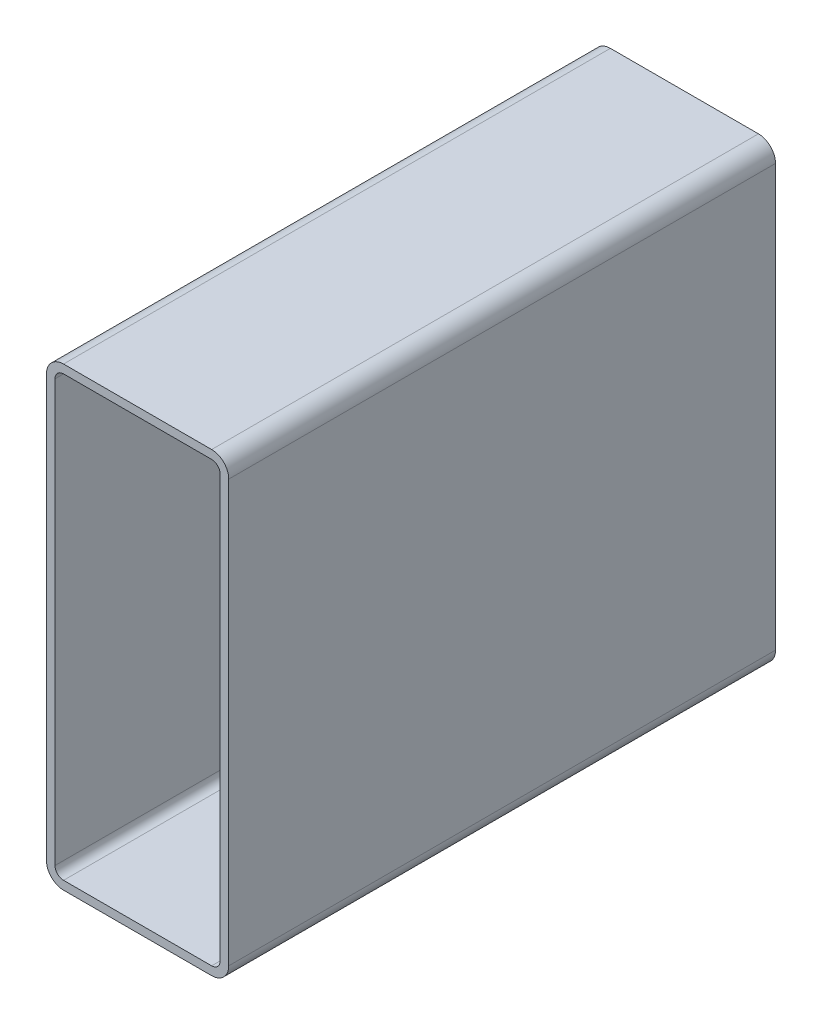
ISO-10303-21;
HEADER;
FILE_DESCRIPTION(('STEP AP214'),'2;1');
FILE_NAME('part.step','',(''),(''),'','','');
FILE_SCHEMA(('AUTOMOTIVE_DESIGN { 1 0 10303 214 1 1 1 1 }'));
ENDSEC;
DATA;
#1=APPLICATION_CONTEXT('core data for automotive mechanical design processes');
#2=APPLICATION_PROTOCOL_DEFINITION('international standard','automotive_design',2000,#1);
#3=PRODUCT_CONTEXT('',#1,'mechanical');
#4=PRODUCT('Part','Part','',(#3));
#5=PRODUCT_RELATED_PRODUCT_CATEGORY('part','',(#4));
#6=PRODUCT_DEFINITION_FORMATION('','',#4);
#7=PRODUCT_DEFINITION_CONTEXT('part definition',#1,'design');
#8=PRODUCT_DEFINITION('design','',#6,#7);
#9=PRODUCT_DEFINITION_SHAPE('','',#8);
#10=(LENGTH_UNIT() NAMED_UNIT(*) SI_UNIT(.MILLI.,.METRE.));
#11=(NAMED_UNIT(*) PLANE_ANGLE_UNIT() SI_UNIT($,.RADIAN.));
#12=(NAMED_UNIT(*) SI_UNIT($,.STERADIAN.) SOLID_ANGLE_UNIT());
#13=UNCERTAINTY_MEASURE_WITH_UNIT(LENGTH_MEASURE(1.E-05),#10,'distance_accuracy_value','');
#14=(GEOMETRIC_REPRESENTATION_CONTEXT(3) GLOBAL_UNCERTAINTY_ASSIGNED_CONTEXT((#13)) GLOBAL_UNIT_ASSIGNED_CONTEXT((#10,
#11,#12)) REPRESENTATION_CONTEXT('',''));
#15=CARTESIAN_POINT('',(0.,0.,0.));
#16=DIRECTION('',(0.,0.,1.));
#17=DIRECTION('',(1.,0.,0.));
#18=AXIS2_PLACEMENT_3D('',#15,#16,#17);
#19=CARTESIAN_POINT('',(11.2001778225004,246.395313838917,304.8));
#20=DIRECTION('',(0.,0.,1.));
#21=DIRECTION('',(1.,0.,0.));
#22=AXIS2_PLACEMENT_3D('',#19,#20,#21);
#23=PLANE('',#22);
#24=CARTESIAN_POINT('',(11.2001778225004,246.395313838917,304.8));
#25=DIRECTION('',(0.,0.,1.));
#26=DIRECTION('',(1.,0.,0.));
#27=AXIS2_PLACEMENT_3D('',#24,#25,#26);
#28=CIRCLE('',#27,9.52500000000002);
#29=CARTESIAN_POINT('',(11.2001778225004,255.920313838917,304.8));
#30=VERTEX_POINT('',#29);
#31=CARTESIAN_POINT('',(1.67517782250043,246.395313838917,304.8));
#32=VERTEX_POINT('',#31);
#33=EDGE_CURVE('E211',#30,#32,#28,.T.);
#34=ORIENTED_EDGE('',*,*,#33,.T.);
#35=DIRECTION('',(0.,-1.,0.));
#36=VECTOR('',#35,1.);
#37=CARTESIAN_POINT('',(1.67517782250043,11.4453138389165,304.8));
#38=LINE('',#37,#36);
#39=CARTESIAN_POINT('',(1.67517782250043,11.4453138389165,304.8));
#40=VERTEX_POINT('',#39);
#41=EDGE_CURVE('E214',#32,#40,#38,.T.);
#42=ORIENTED_EDGE('',*,*,#41,.T.);
#43=CARTESIAN_POINT('',(11.2001778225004,11.4453138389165,304.8));
#44=DIRECTION('',(0.,0.,1.));
#45=DIRECTION('',(1.,0.,0.));
#46=AXIS2_PLACEMENT_3D('',#43,#44,#45);
#47=CIRCLE('',#46,9.525);
#48=CARTESIAN_POINT('',(11.2001778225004,1.92031383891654,304.8));
#49=VERTEX_POINT('',#48);
#50=EDGE_CURVE('E217',#40,#49,#47,.T.);
#51=ORIENTED_EDGE('',*,*,#50,.T.);
#52=DIRECTION('',(1.,0.,0.));
#53=VECTOR('',#52,1.);
#54=CARTESIAN_POINT('',(93.7501778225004,1.92031383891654,304.8));
#55=LINE('',#54,#53);
#56=CARTESIAN_POINT('',(93.7501778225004,1.92031383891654,304.8));
#57=VERTEX_POINT('',#56);
#58=EDGE_CURVE('E219',#49,#57,#55,.T.);
#59=ORIENTED_EDGE('',*,*,#58,.T.);
#60=CARTESIAN_POINT('',(93.7501778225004,11.4453138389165,304.8));
#61=DIRECTION('',(0.,0.,1.));
#62=DIRECTION('',(1.,0.,0.));
#63=AXIS2_PLACEMENT_3D('',#60,#61,#62);
#64=CIRCLE('',#63,9.52500000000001);
#65=CARTESIAN_POINT('',(103.2751778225,11.4453138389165,304.8));
#66=VERTEX_POINT('',#65);
#67=EDGE_CURVE('E221',#57,#66,#64,.T.);
#68=ORIENTED_EDGE('',*,*,#67,.T.);
#69=DIRECTION('',(0.,1.,0.));
#70=VECTOR('',#69,1.);
#71=CARTESIAN_POINT('',(103.2751778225,246.395313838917,304.8));
#72=LINE('',#71,#70);
#73=CARTESIAN_POINT('',(103.2751778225,246.395313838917,304.8));
#74=VERTEX_POINT('',#73);
#75=EDGE_CURVE('E223',#66,#74,#72,.T.);
#76=ORIENTED_EDGE('',*,*,#75,.T.);
#77=CARTESIAN_POINT('',(93.7501778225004,246.395313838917,304.8));
#78=DIRECTION('',(0.,0.,1.));
#79=DIRECTION('',(1.,0.,0.));
#80=AXIS2_PLACEMENT_3D('',#77,#78,#79);
#81=CIRCLE('',#80,9.52500000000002);
#82=CARTESIAN_POINT('',(93.7501778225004,255.920313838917,304.8));
#83=VERTEX_POINT('',#82);
#84=EDGE_CURVE('E225',#74,#83,#81,.T.);
#85=ORIENTED_EDGE('',*,*,#84,.T.);
#86=DIRECTION('',(-1.,0.,0.));
#87=VECTOR('',#86,1.);
#88=CARTESIAN_POINT('',(11.2001778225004,255.920313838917,304.8));
#89=LINE('',#88,#87);
#90=EDGE_CURVE('E227',#83,#30,#89,.T.);
#91=ORIENTED_EDGE('',*,*,#90,.T.);
#92=EDGE_LOOP('',(#34,#42,#51,#59,#68,#76,#85,#91));
#93=FACE_BOUND('',#92,.T.);
#94=DIRECTION('',(0.,-1.,0.));
#95=VECTOR('',#94,1.);
#96=CARTESIAN_POINT('',(6.43767782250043,11.4453138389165,304.8));
#97=LINE('',#96,#95);
#98=CARTESIAN_POINT('',(6.43767782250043,246.395313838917,304.8));
#99=VERTEX_POINT('',#98);
#100=CARTESIAN_POINT('',(6.43767782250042,11.4453138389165,304.8));
#101=VERTEX_POINT('',#100);
#102=EDGE_CURVE('E154',#99,#101,#97,.T.);
#103=ORIENTED_EDGE('',*,*,#102,.F.);
#104=CARTESIAN_POINT('',(11.2001778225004,246.395313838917,304.8));
#105=DIRECTION('',(0.,0.,1.));
#106=DIRECTION('',(1.,0.,0.));
#107=AXIS2_PLACEMENT_3D('',#104,#105,#106);
#108=CIRCLE('',#107,4.76250000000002);
#109=CARTESIAN_POINT('',(11.2001778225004,251.157813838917,304.8));
#110=VERTEX_POINT('',#109);
#111=EDGE_CURVE('E146',#110,#99,#108,.T.);
#112=ORIENTED_EDGE('',*,*,#111,.F.);
#113=DIRECTION('',(-1.,0.,0.));
#114=VECTOR('',#113,1.);
#115=CARTESIAN_POINT('',(11.2001778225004,251.157813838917,304.8));
#116=LINE('',#115,#114);
#117=CARTESIAN_POINT('',(93.7501778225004,251.157813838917,304.8));
#118=VERTEX_POINT('',#117);
#119=EDGE_CURVE('E179',#118,#110,#116,.T.);
#120=ORIENTED_EDGE('',*,*,#119,.F.);
#121=CARTESIAN_POINT('',(93.7501778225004,246.395313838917,304.8));
#122=DIRECTION('',(0.,0.,1.));
#123=DIRECTION('',(1.,0.,0.));
#124=AXIS2_PLACEMENT_3D('',#121,#122,#123);
#125=CIRCLE('',#124,4.76250000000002);
#126=CARTESIAN_POINT('',(98.5126778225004,246.395313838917,304.8));
#127=VERTEX_POINT('',#126);
#128=EDGE_CURVE('E177',#127,#118,#125,.T.);
#129=ORIENTED_EDGE('',*,*,#128,.F.);
#130=DIRECTION('',(0.,1.,0.));
#131=VECTOR('',#130,1.);
#132=CARTESIAN_POINT('',(98.5126778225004,246.395313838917,304.8));
#133=LINE('',#132,#131);
#134=CARTESIAN_POINT('',(98.5126778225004,11.4453138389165,304.8));
#135=VERTEX_POINT('',#134);
#136=EDGE_CURVE('E175',#135,#127,#133,.T.);
#137=ORIENTED_EDGE('',*,*,#136,.F.);
#138=CARTESIAN_POINT('',(93.7501778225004,11.4453138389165,304.8));
#139=DIRECTION('',(0.,0.,1.));
#140=DIRECTION('',(1.,0.,0.));
#141=AXIS2_PLACEMENT_3D('',#138,#139,#140);
#142=CIRCLE('',#141,4.7625);
#143=CARTESIAN_POINT('',(93.7501778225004,6.68281383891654,304.8));
#144=VERTEX_POINT('',#143);
#145=EDGE_CURVE('E173',#144,#135,#142,.T.);
#146=ORIENTED_EDGE('',*,*,#145,.F.);
#147=DIRECTION('',(1.,0.,0.));
#148=VECTOR('',#147,1.);
#149=CARTESIAN_POINT('',(93.7501778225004,6.68281383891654,304.8));
#150=LINE('',#149,#148);
#151=CARTESIAN_POINT('',(11.2001778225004,6.68281383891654,304.8));
#152=VERTEX_POINT('',#151);
#153=EDGE_CURVE('E169',#152,#144,#150,.T.);
#154=ORIENTED_EDGE('',*,*,#153,.F.);
#155=CARTESIAN_POINT('',(11.2001778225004,11.4453138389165,304.8));
#156=DIRECTION('',(0.,0.,1.));
#157=DIRECTION('',(1.,0.,0.));
#158=AXIS2_PLACEMENT_3D('',#155,#156,#157);
#159=CIRCLE('',#158,4.7625);
#160=EDGE_CURVE('E167',#101,#152,#159,.T.);
#161=ORIENTED_EDGE('',*,*,#160,.F.);
#162=EDGE_LOOP('',(#103,#112,#120,#129,#137,#146,#154,#161));
#163=FACE_BOUND('',#162,.T.);
#164=ADVANCED_FACE('F33',(#93,#163),#23,.T.);
#165=CARTESIAN_POINT('',(11.2001778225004,246.395313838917,0.));
#166=DIRECTION('',(0.,0.,1.));
#167=DIRECTION('',(1.,0.,0.));
#168=AXIS2_PLACEMENT_3D('',#165,#166,#167);
#169=PLANE('',#168);
#170=CARTESIAN_POINT('',(11.2001778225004,246.395313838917,0.));
#171=DIRECTION('',(0.,0.,1.));
#172=DIRECTION('',(1.,0.,0.));
#173=AXIS2_PLACEMENT_3D('',#170,#171,#172);
#174=CIRCLE('',#173,9.52500000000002);
#175=CARTESIAN_POINT('',(11.2001778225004,255.920313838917,0.));
#176=VERTEX_POINT('',#175);
#177=CARTESIAN_POINT('',(1.67517782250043,246.395313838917,0.));
#178=VERTEX_POINT('',#177);
#179=EDGE_CURVE('E162',#176,#178,#174,.T.);
#180=ORIENTED_EDGE('',*,*,#179,.F.);
#181=DIRECTION('',(-1.,0.,0.));
#182=VECTOR('',#181,1.);
#183=CARTESIAN_POINT('',(11.2001778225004,255.920313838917,0.));
#184=LINE('',#183,#182);
#185=CARTESIAN_POINT('',(93.7501778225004,255.920313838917,0.));
#186=VERTEX_POINT('',#185);
#187=EDGE_CURVE('E215',#186,#176,#184,.T.);
#188=ORIENTED_EDGE('',*,*,#187,.F.);
#189=CARTESIAN_POINT('',(93.7501778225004,246.395313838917,0.));
#190=DIRECTION('',(0.,0.,1.));
#191=DIRECTION('',(1.,0.,0.));
#192=AXIS2_PLACEMENT_3D('',#189,#190,#191);
#193=CIRCLE('',#192,9.52500000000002);
#194=CARTESIAN_POINT('',(103.2751778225,246.395313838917,0.));
#195=VERTEX_POINT('',#194);
#196=EDGE_CURVE('E242',#195,#186,#193,.T.);
#197=ORIENTED_EDGE('',*,*,#196,.F.);
#198=DIRECTION('',(0.,1.,0.));
#199=VECTOR('',#198,1.);
#200=CARTESIAN_POINT('',(103.2751778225,246.395313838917,0.));
#201=LINE('',#200,#199);
#202=CARTESIAN_POINT('',(103.2751778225,11.4453138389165,0.));
#203=VERTEX_POINT('',#202);
#204=EDGE_CURVE('E240',#203,#195,#201,.T.);
#205=ORIENTED_EDGE('',*,*,#204,.F.);
#206=CARTESIAN_POINT('',(93.7501778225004,11.4453138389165,0.));
#207=DIRECTION('',(0.,0.,1.));
#208=DIRECTION('',(1.,0.,0.));
#209=AXIS2_PLACEMENT_3D('',#206,#207,#208);
#210=CIRCLE('',#209,9.52500000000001);
#211=CARTESIAN_POINT('',(93.7501778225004,1.92031383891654,0.));
#212=VERTEX_POINT('',#211);
#213=EDGE_CURVE('E238',#212,#203,#210,.T.);
#214=ORIENTED_EDGE('',*,*,#213,.F.);
#215=DIRECTION('',(1.,0.,0.));
#216=VECTOR('',#215,1.);
#217=CARTESIAN_POINT('',(93.7501778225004,1.92031383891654,0.));
#218=LINE('',#217,#216);
#219=CARTESIAN_POINT('',(11.2001778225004,1.92031383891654,0.));
#220=VERTEX_POINT('',#219);
#221=EDGE_CURVE('E236',#220,#212,#218,.T.);
#222=ORIENTED_EDGE('',*,*,#221,.F.);
#223=CARTESIAN_POINT('',(11.2001778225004,11.4453138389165,0.));
#224=DIRECTION('',(0.,0.,1.));
#225=DIRECTION('',(1.,0.,0.));
#226=AXIS2_PLACEMENT_3D('',#223,#224,#225);
#227=CIRCLE('',#226,9.525);
#228=CARTESIAN_POINT('',(1.67517782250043,11.4453138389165,0.));
#229=VERTEX_POINT('',#228);
#230=EDGE_CURVE('E234',#229,#220,#227,.T.);
#231=ORIENTED_EDGE('',*,*,#230,.F.);
#232=DIRECTION('',(0.,-1.,0.));
#233=VECTOR('',#232,1.);
#234=CARTESIAN_POINT('',(1.67517782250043,11.4453138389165,0.));
#235=LINE('',#234,#233);
#236=EDGE_CURVE('E232',#178,#229,#235,.T.);
#237=ORIENTED_EDGE('',*,*,#236,.F.);
#238=EDGE_LOOP('',(#180,#188,#197,#205,#214,#222,#231,#237));
#239=FACE_BOUND('',#238,.T.);
#240=CARTESIAN_POINT('',(11.2001778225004,246.395313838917,0.));
#241=DIRECTION('',(0.,0.,1.));
#242=DIRECTION('',(1.,0.,0.));
#243=AXIS2_PLACEMENT_3D('',#240,#241,#242);
#244=CIRCLE('',#243,4.76250000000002);
#245=CARTESIAN_POINT('',(11.2001778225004,251.157813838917,0.));
#246=VERTEX_POINT('',#245);
#247=CARTESIAN_POINT('',(6.43767782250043,246.395313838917,0.));
#248=VERTEX_POINT('',#247);
#249=EDGE_CURVE('E56',#246,#248,#244,.T.);
#250=ORIENTED_EDGE('',*,*,#249,.T.);
#251=DIRECTION('',(0.,-1.,0.));
#252=VECTOR('',#251,1.);
#253=CARTESIAN_POINT('',(6.43767782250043,11.4453138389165,0.));
#254=LINE('',#253,#252);
#255=CARTESIAN_POINT('',(6.43767782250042,11.4453138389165,0.));
#256=VERTEX_POINT('',#255);
#257=EDGE_CURVE('E161',#248,#256,#254,.T.);
#258=ORIENTED_EDGE('',*,*,#257,.T.);
#259=CARTESIAN_POINT('',(11.2001778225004,11.4453138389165,0.));
#260=DIRECTION('',(0.,0.,1.));
#261=DIRECTION('',(1.,0.,0.));
#262=AXIS2_PLACEMENT_3D('',#259,#260,#261);
#263=CIRCLE('',#262,4.7625);
#264=CARTESIAN_POINT('',(11.2001778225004,6.68281383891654,0.));
#265=VERTEX_POINT('',#264);
#266=EDGE_CURVE('E183',#256,#265,#263,.T.);
#267=ORIENTED_EDGE('',*,*,#266,.T.);
#268=DIRECTION('',(1.,0.,0.));
#269=VECTOR('',#268,1.);
#270=CARTESIAN_POINT('',(93.7501778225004,6.68281383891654,0.));
#271=LINE('',#270,#269);
#272=CARTESIAN_POINT('',(93.7501778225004,6.68281383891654,0.));
#273=VERTEX_POINT('',#272);
#274=EDGE_CURVE('E186',#265,#273,#271,.T.);
#275=ORIENTED_EDGE('',*,*,#274,.T.);
#276=CARTESIAN_POINT('',(93.7501778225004,11.4453138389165,0.));
#277=DIRECTION('',(0.,0.,1.));
#278=DIRECTION('',(1.,0.,0.));
#279=AXIS2_PLACEMENT_3D('',#276,#277,#278);
#280=CIRCLE('',#279,4.7625);
#281=CARTESIAN_POINT('',(98.5126778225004,11.4453138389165,0.));
#282=VERTEX_POINT('',#281);
#283=EDGE_CURVE('E189',#273,#282,#280,.T.);
#284=ORIENTED_EDGE('',*,*,#283,.T.);
#285=DIRECTION('',(0.,1.,0.));
#286=VECTOR('',#285,1.);
#287=CARTESIAN_POINT('',(98.5126778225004,246.395313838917,0.));
#288=LINE('',#287,#286);
#289=CARTESIAN_POINT('',(98.5126778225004,246.395313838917,0.));
#290=VERTEX_POINT('',#289);
#291=EDGE_CURVE('E192',#282,#290,#288,.T.);
#292=ORIENTED_EDGE('',*,*,#291,.T.);
#293=CARTESIAN_POINT('',(93.7501778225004,246.395313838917,0.));
#294=DIRECTION('',(0.,0.,1.));
#295=DIRECTION('',(1.,0.,0.));
#296=AXIS2_PLACEMENT_3D('',#293,#294,#295);
#297=CIRCLE('',#296,4.76250000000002);
#298=CARTESIAN_POINT('',(93.7501778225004,251.157813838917,0.));
#299=VERTEX_POINT('',#298);
#300=EDGE_CURVE('E195',#290,#299,#297,.T.);
#301=ORIENTED_EDGE('',*,*,#300,.T.);
#302=DIRECTION('',(-1.,0.,0.));
#303=VECTOR('',#302,1.);
#304=CARTESIAN_POINT('',(11.2001778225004,251.157813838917,0.));
#305=LINE('',#304,#303);
#306=EDGE_CURVE('E155',#299,#246,#305,.T.);
#307=ORIENTED_EDGE('',*,*,#306,.T.);
#308=EDGE_LOOP('',(#250,#258,#267,#275,#284,#292,#301,#307));
#309=FACE_BOUND('',#308,.T.);
#310=ADVANCED_FACE('F272',(#239,#309),#169,.F.);
#311=CARTESIAN_POINT('',(11.2001778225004,246.395313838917,304.8));
#312=DIRECTION('',(0.,0.,-1.));
#313=DIRECTION('',(-1.,0.,0.));
#314=AXIS2_PLACEMENT_3D('',#311,#312,#313);
#315=CYLINDRICAL_SURFACE('',#314,9.52500000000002);
#316=ORIENTED_EDGE('',*,*,#179,.T.);
#317=DIRECTION('',(0.,0.,-1.));
#318=VECTOR('',#317,1.);
#319=CARTESIAN_POINT('',(1.67517782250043,246.395313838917,304.8));
#320=LINE('',#319,#318);
#321=EDGE_CURVE('E11',#32,#178,#320,.T.);
#322=ORIENTED_EDGE('',*,*,#321,.F.);
#323=ORIENTED_EDGE('',*,*,#33,.F.);
#324=DIRECTION('',(0.,0.,-1.));
#325=VECTOR('',#324,1.);
#326=CARTESIAN_POINT('',(11.2001778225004,255.920313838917,304.8));
#327=LINE('',#326,#325);
#328=EDGE_CURVE('E229',#30,#176,#327,.T.);
#329=ORIENTED_EDGE('',*,*,#328,.T.);
#330=EDGE_LOOP('',(#316,#322,#323,#329));
#331=FACE_BOUND('',#330,.T.);
#332=ADVANCED_FACE('F35',(#331),#315,.T.);
#333=CARTESIAN_POINT('',(1.67517782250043,11.4453138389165,304.8));
#334=DIRECTION('',(1.,0.,0.));
#335=DIRECTION('',(0.,0.,-1.));
#336=AXIS2_PLACEMENT_3D('',#333,#334,#335);
#337=PLANE('',#336);
#338=ORIENTED_EDGE('',*,*,#236,.T.);
#339=DIRECTION('',(0.,0.,-1.));
#340=VECTOR('',#339,1.);
#341=CARTESIAN_POINT('',(1.67517782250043,11.4453138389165,304.8));
#342=LINE('',#341,#340);
#343=EDGE_CURVE('E41',#40,#229,#342,.T.);
#344=ORIENTED_EDGE('',*,*,#343,.F.);
#345=ORIENTED_EDGE('',*,*,#41,.F.);
#346=ORIENTED_EDGE('',*,*,#321,.T.);
#347=EDGE_LOOP('',(#338,#344,#345,#346));
#348=FACE_BOUND('',#347,.T.);
#349=ADVANCED_FACE('F289',(#348),#337,.F.);
#350=CARTESIAN_POINT('',(11.2001778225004,11.4453138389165,304.8));
#351=DIRECTION('',(0.,0.,-1.));
#352=DIRECTION('',(-1.,0.,0.));
#353=AXIS2_PLACEMENT_3D('',#350,#351,#352);
#354=CYLINDRICAL_SURFACE('',#353,9.525);
#355=ORIENTED_EDGE('',*,*,#230,.T.);
#356=DIRECTION('',(0.,0.,-1.));
#357=VECTOR('',#356,1.);
#358=CARTESIAN_POINT('',(11.2001778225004,1.92031383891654,304.8));
#359=LINE('',#358,#357);
#360=EDGE_CURVE('E259',#49,#220,#359,.T.);
#361=ORIENTED_EDGE('',*,*,#360,.F.);
#362=ORIENTED_EDGE('',*,*,#50,.F.);
#363=ORIENTED_EDGE('',*,*,#343,.T.);
#364=EDGE_LOOP('',(#355,#361,#362,#363));
#365=FACE_BOUND('',#364,.T.);
#366=ADVANCED_FACE('F266',(#365),#354,.T.);
#367=CARTESIAN_POINT('',(93.7501778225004,1.92031383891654,304.8));
#368=DIRECTION('',(0.,1.,0.));
#369=DIRECTION('',(0.,0.,1.));
#370=AXIS2_PLACEMENT_3D('',#367,#368,#369);
#371=PLANE('',#370);
#372=ORIENTED_EDGE('',*,*,#221,.T.);
#373=DIRECTION('',(0.,0.,-1.));
#374=VECTOR('',#373,1.);
#375=CARTESIAN_POINT('',(93.7501778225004,1.92031383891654,304.8));
#376=LINE('',#375,#374);
#377=EDGE_CURVE('E256',#57,#212,#376,.T.);
#378=ORIENTED_EDGE('',*,*,#377,.F.);
#379=ORIENTED_EDGE('',*,*,#58,.F.);
#380=ORIENTED_EDGE('',*,*,#360,.T.);
#381=EDGE_LOOP('',(#372,#378,#379,#380));
#382=FACE_BOUND('',#381,.T.);
#383=ADVANCED_FACE('F278',(#382),#371,.F.);
#384=CARTESIAN_POINT('',(93.7501778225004,11.4453138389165,304.8));
#385=DIRECTION('',(0.,0.,-1.));
#386=DIRECTION('',(-1.,0.,0.));
#387=AXIS2_PLACEMENT_3D('',#384,#385,#386);
#388=CYLINDRICAL_SURFACE('',#387,9.52500000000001);
#389=ORIENTED_EDGE('',*,*,#213,.T.);
#390=DIRECTION('',(0.,0.,-1.));
#391=VECTOR('',#390,1.);
#392=CARTESIAN_POINT('',(103.2751778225,11.4453138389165,304.8));
#393=LINE('',#392,#391);
#394=EDGE_CURVE('E253',#66,#203,#393,.T.);
#395=ORIENTED_EDGE('',*,*,#394,.F.);
#396=ORIENTED_EDGE('',*,*,#67,.F.);
#397=ORIENTED_EDGE('',*,*,#377,.T.);
#398=EDGE_LOOP('',(#389,#395,#396,#397));
#399=FACE_BOUND('',#398,.T.);
#400=ADVANCED_FACE('F282',(#399),#388,.T.);
#401=CARTESIAN_POINT('',(103.2751778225,246.395313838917,304.8));
#402=DIRECTION('',(-1.,0.,0.));
#403=DIRECTION('',(0.,0.,1.));
#404=AXIS2_PLACEMENT_3D('',#401,#402,#403);
#405=PLANE('',#404);
#406=ORIENTED_EDGE('',*,*,#204,.T.);
#407=DIRECTION('',(0.,0.,-1.));
#408=VECTOR('',#407,1.);
#409=CARTESIAN_POINT('',(103.2751778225,246.395313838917,304.8));
#410=LINE('',#409,#408);
#411=EDGE_CURVE('E250',#74,#195,#410,.T.);
#412=ORIENTED_EDGE('',*,*,#411,.F.);
#413=ORIENTED_EDGE('',*,*,#75,.F.);
#414=ORIENTED_EDGE('',*,*,#394,.T.);
#415=EDGE_LOOP('',(#406,#412,#413,#414));
#416=FACE_BOUND('',#415,.T.);
#417=ADVANCED_FACE('F302',(#416),#405,.F.);
#418=CARTESIAN_POINT('',(93.7501778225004,246.395313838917,304.8));
#419=DIRECTION('',(0.,0.,-1.));
#420=DIRECTION('',(-1.,0.,0.));
#421=AXIS2_PLACEMENT_3D('',#418,#419,#420);
#422=CYLINDRICAL_SURFACE('',#421,9.52500000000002);
#423=ORIENTED_EDGE('',*,*,#196,.T.);
#424=DIRECTION('',(0.,0.,-1.));
#425=VECTOR('',#424,1.);
#426=CARTESIAN_POINT('',(93.7501778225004,255.920313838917,304.8));
#427=LINE('',#426,#425);
#428=EDGE_CURVE('E247',#83,#186,#427,.T.);
#429=ORIENTED_EDGE('',*,*,#428,.F.);
#430=ORIENTED_EDGE('',*,*,#84,.F.);
#431=ORIENTED_EDGE('',*,*,#411,.T.);
#432=EDGE_LOOP('',(#423,#429,#430,#431));
#433=FACE_BOUND('',#432,.T.);
#434=ADVANCED_FACE('F300',(#433),#422,.T.);
#435=CARTESIAN_POINT('',(11.2001778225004,255.920313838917,304.8));
#436=DIRECTION('',(0.,-1.,0.));
#437=DIRECTION('',(0.,0.,-1.));
#438=AXIS2_PLACEMENT_3D('',#435,#436,#437);
#439=PLANE('',#438);
#440=ORIENTED_EDGE('',*,*,#187,.T.);
#441=ORIENTED_EDGE('',*,*,#328,.F.);
#442=ORIENTED_EDGE('',*,*,#90,.F.);
#443=ORIENTED_EDGE('',*,*,#428,.T.);
#444=EDGE_LOOP('',(#440,#441,#442,#443));
#445=FACE_BOUND('',#444,.T.);
#446=ADVANCED_FACE('F295',(#445),#439,.F.);
#447=CARTESIAN_POINT('',(11.2001778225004,246.395313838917,304.8));
#448=DIRECTION('',(0.,0.,-1.));
#449=DIRECTION('',(-1.,0.,0.));
#450=AXIS2_PLACEMENT_3D('',#447,#448,#449);
#451=CYLINDRICAL_SURFACE('',#450,4.76250000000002);
#452=ORIENTED_EDGE('',*,*,#249,.F.);
#453=DIRECTION('',(0.,0.,-1.));
#454=VECTOR('',#453,1.);
#455=CARTESIAN_POINT('',(11.2001778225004,251.157813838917,304.8));
#456=LINE('',#455,#454);
#457=EDGE_CURVE('E150',#110,#246,#456,.T.);
#458=ORIENTED_EDGE('',*,*,#457,.F.);
#459=ORIENTED_EDGE('',*,*,#111,.T.);
#460=DIRECTION('',(0.,0.,-1.));
#461=VECTOR('',#460,1.);
#462=CARTESIAN_POINT('',(6.43767782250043,246.395313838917,304.8));
#463=LINE('',#462,#461);
#464=EDGE_CURVE('E149',#99,#248,#463,.T.);
#465=ORIENTED_EDGE('',*,*,#464,.T.);
#466=EDGE_LOOP('',(#452,#458,#459,#465));
#467=FACE_BOUND('',#466,.T.);
#468=ADVANCED_FACE('F148',(#467),#451,.F.);
#469=CARTESIAN_POINT('',(6.43767782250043,11.4453138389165,304.8));
#470=DIRECTION('',(1.,0.,0.));
#471=DIRECTION('',(0.,0.,-1.));
#472=AXIS2_PLACEMENT_3D('',#469,#470,#471);
#473=PLANE('',#472);
#474=ORIENTED_EDGE('',*,*,#257,.F.);
#475=ORIENTED_EDGE('',*,*,#464,.F.);
#476=ORIENTED_EDGE('',*,*,#102,.T.);
#477=DIRECTION('',(0.,0.,-1.));
#478=VECTOR('',#477,1.);
#479=CARTESIAN_POINT('',(6.43767782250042,11.4453138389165,304.8));
#480=LINE('',#479,#478);
#481=EDGE_CURVE('E163',#101,#256,#480,.T.);
#482=ORIENTED_EDGE('',*,*,#481,.T.);
#483=EDGE_LOOP('',(#474,#475,#476,#482));
#484=FACE_BOUND('',#483,.T.);
#485=ADVANCED_FACE('F158',(#484),#473,.T.);
#486=CARTESIAN_POINT('',(11.2001778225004,11.4453138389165,304.8));
#487=DIRECTION('',(0.,0.,-1.));
#488=DIRECTION('',(-1.,0.,0.));
#489=AXIS2_PLACEMENT_3D('',#486,#487,#488);
#490=CYLINDRICAL_SURFACE('',#489,4.7625);
#491=ORIENTED_EDGE('',*,*,#266,.F.);
#492=ORIENTED_EDGE('',*,*,#481,.F.);
#493=ORIENTED_EDGE('',*,*,#160,.T.);
#494=DIRECTION('',(0.,0.,-1.));
#495=VECTOR('',#494,1.);
#496=CARTESIAN_POINT('',(11.2001778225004,6.68281383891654,304.8));
#497=LINE('',#496,#495);
#498=EDGE_CURVE('E208',#152,#265,#497,.T.);
#499=ORIENTED_EDGE('',*,*,#498,.T.);
#500=EDGE_LOOP('',(#491,#492,#493,#499));
#501=FACE_BOUND('',#500,.T.);
#502=ADVANCED_FACE('F327',(#501),#490,.F.);
#503=CARTESIAN_POINT('',(93.7501778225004,6.68281383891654,304.8));
#504=DIRECTION('',(0.,1.,0.));
#505=DIRECTION('',(0.,0.,1.));
#506=AXIS2_PLACEMENT_3D('',#503,#504,#505);
#507=PLANE('',#506);
#508=ORIENTED_EDGE('',*,*,#274,.F.);
#509=ORIENTED_EDGE('',*,*,#498,.F.);
#510=ORIENTED_EDGE('',*,*,#153,.T.);
#511=DIRECTION('',(0.,0.,-1.));
#512=VECTOR('',#511,1.);
#513=CARTESIAN_POINT('',(93.7501778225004,6.68281383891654,304.8));
#514=LINE('',#513,#512);
#515=EDGE_CURVE('E206',#144,#273,#514,.T.);
#516=ORIENTED_EDGE('',*,*,#515,.T.);
#517=EDGE_LOOP('',(#508,#509,#510,#516));
#518=FACE_BOUND('',#517,.T.);
#519=ADVANCED_FACE('F331',(#518),#507,.T.);
#520=CARTESIAN_POINT('',(93.7501778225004,11.4453138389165,304.8));
#521=DIRECTION('',(0.,0.,-1.));
#522=DIRECTION('',(-1.,0.,0.));
#523=AXIS2_PLACEMENT_3D('',#520,#521,#522);
#524=CYLINDRICAL_SURFACE('',#523,4.7625);
#525=ORIENTED_EDGE('',*,*,#283,.F.);
#526=ORIENTED_EDGE('',*,*,#515,.F.);
#527=ORIENTED_EDGE('',*,*,#145,.T.);
#528=DIRECTION('',(0.,0.,-1.));
#529=VECTOR('',#528,1.);
#530=CARTESIAN_POINT('',(98.5126778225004,11.4453138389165,304.8));
#531=LINE('',#530,#529);
#532=EDGE_CURVE('E204',#135,#282,#531,.T.);
#533=ORIENTED_EDGE('',*,*,#532,.T.);
#534=EDGE_LOOP('',(#525,#526,#527,#533));
#535=FACE_BOUND('',#534,.T.);
#536=ADVANCED_FACE('F337',(#535),#524,.F.);
#537=CARTESIAN_POINT('',(98.5126778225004,246.395313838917,304.8));
#538=DIRECTION('',(-1.,0.,0.));
#539=DIRECTION('',(0.,0.,1.));
#540=AXIS2_PLACEMENT_3D('',#537,#538,#539);
#541=PLANE('',#540);
#542=ORIENTED_EDGE('',*,*,#291,.F.);
#543=ORIENTED_EDGE('',*,*,#532,.F.);
#544=ORIENTED_EDGE('',*,*,#136,.T.);
#545=DIRECTION('',(0.,0.,-1.));
#546=VECTOR('',#545,1.);
#547=CARTESIAN_POINT('',(98.5126778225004,246.395313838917,304.8));
#548=LINE('',#547,#546);
#549=EDGE_CURVE('E202',#127,#290,#548,.T.);
#550=ORIENTED_EDGE('',*,*,#549,.T.);
#551=EDGE_LOOP('',(#542,#543,#544,#550));
#552=FACE_BOUND('',#551,.T.);
#553=ADVANCED_FACE('F341',(#552),#541,.T.);
#554=CARTESIAN_POINT('',(93.7501778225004,246.395313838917,304.8));
#555=DIRECTION('',(0.,0.,-1.));
#556=DIRECTION('',(-1.,0.,0.));
#557=AXIS2_PLACEMENT_3D('',#554,#555,#556);
#558=CYLINDRICAL_SURFACE('',#557,4.76250000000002);
#559=ORIENTED_EDGE('',*,*,#300,.F.);
#560=ORIENTED_EDGE('',*,*,#549,.F.);
#561=ORIENTED_EDGE('',*,*,#128,.T.);
#562=DIRECTION('',(0.,0.,-1.));
#563=VECTOR('',#562,1.);
#564=CARTESIAN_POINT('',(93.7501778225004,251.157813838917,304.8));
#565=LINE('',#564,#563);
#566=EDGE_CURVE('E48',#118,#299,#565,.T.);
#567=ORIENTED_EDGE('',*,*,#566,.T.);
#568=EDGE_LOOP('',(#559,#560,#561,#567));
#569=FACE_BOUND('',#568,.T.);
#570=ADVANCED_FACE('F345',(#569),#558,.F.);
#571=CARTESIAN_POINT('',(11.2001778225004,251.157813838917,304.8));
#572=DIRECTION('',(0.,-1.,0.));
#573=DIRECTION('',(0.,0.,-1.));
#574=AXIS2_PLACEMENT_3D('',#571,#572,#573);
#575=PLANE('',#574);
#576=ORIENTED_EDGE('',*,*,#306,.F.);
#577=ORIENTED_EDGE('',*,*,#566,.F.);
#578=ORIENTED_EDGE('',*,*,#119,.T.);
#579=ORIENTED_EDGE('',*,*,#457,.T.);
#580=EDGE_LOOP('',(#576,#577,#578,#579));
#581=FACE_BOUND('',#580,.T.);
#582=ADVANCED_FACE('F349',(#581),#575,.T.);
#583=CLOSED_SHELL('',(#164,#310,#332,#349,#366,#383,#400,#417,#434,#446,#468,#485,#502,#519,
#536,#553,#570,#582));
#584=MANIFOLD_SOLID_BREP('B2',#583);
#585=ADVANCED_BREP_SHAPE_REPRESENTATION('',(#18,#584),#14);
#586=SHAPE_DEFINITION_REPRESENTATION(#9,#585);
ENDSEC;
END-ISO-10303-21;
